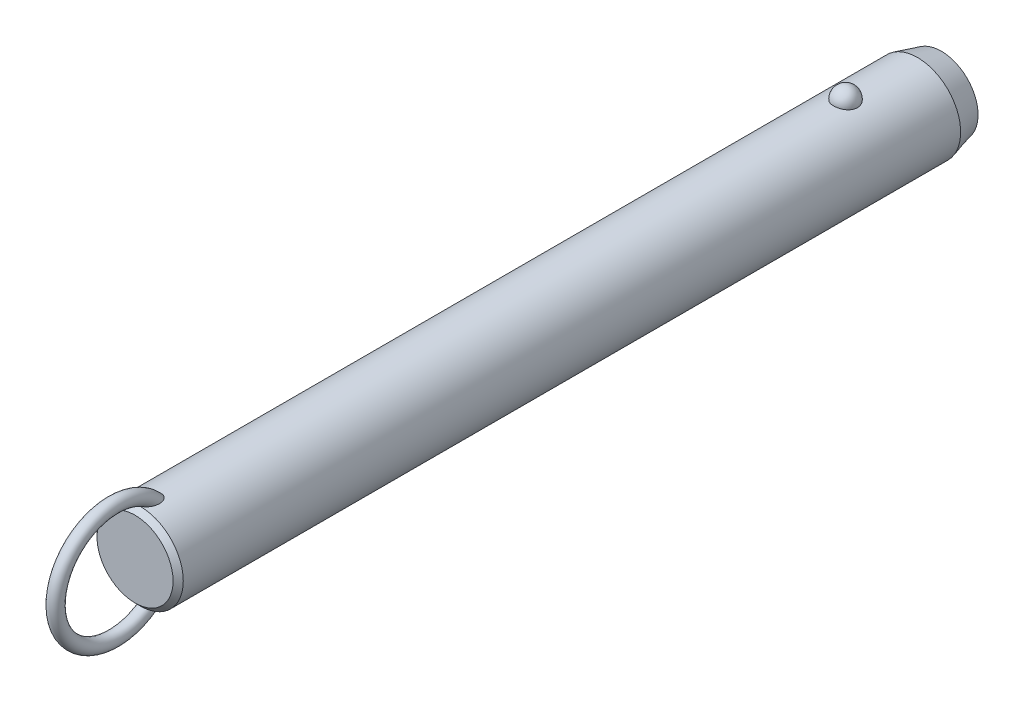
ISO-10303-21;
HEADER;
FILE_DESCRIPTION(('STEP AP214'),'2;1');
FILE_NAME('part.step','',(''),(''),'','','');
FILE_SCHEMA(('AUTOMOTIVE_DESIGN { 1 0 10303 214 1 1 1 1 }'));
ENDSEC;
DATA;
#1=APPLICATION_CONTEXT('core data for automotive mechanical design processes');
#2=APPLICATION_PROTOCOL_DEFINITION('international standard','automotive_design',2000,#1);
#3=PRODUCT_CONTEXT('',#1,'mechanical');
#4=PRODUCT('Part','Part','',(#3));
#5=PRODUCT_RELATED_PRODUCT_CATEGORY('part','',(#4));
#6=PRODUCT_DEFINITION_FORMATION('','',#4);
#7=PRODUCT_DEFINITION_CONTEXT('part definition',#1,'design');
#8=PRODUCT_DEFINITION('design','',#6,#7);
#9=PRODUCT_DEFINITION_SHAPE('','',#8);
#10=(LENGTH_UNIT() NAMED_UNIT(*) SI_UNIT(.MILLI.,.METRE.));
#11=(NAMED_UNIT(*) PLANE_ANGLE_UNIT() SI_UNIT($,.RADIAN.));
#12=(NAMED_UNIT(*) SI_UNIT($,.STERADIAN.) SOLID_ANGLE_UNIT());
#13=UNCERTAINTY_MEASURE_WITH_UNIT(LENGTH_MEASURE(1.E-05),#10,'distance_accuracy_value','');
#14=(GEOMETRIC_REPRESENTATION_CONTEXT(3) GLOBAL_UNCERTAINTY_ASSIGNED_CONTEXT((#13)) GLOBAL_UNIT_ASSIGNED_CONTEXT((#10,
#11,#12)) REPRESENTATION_CONTEXT('',''));
#15=CARTESIAN_POINT('',(0.,0.,0.));
#16=DIRECTION('',(0.,0.,1.));
#17=DIRECTION('',(1.,0.,0.));
#18=AXIS2_PLACEMENT_3D('',#15,#16,#17);
#19=CARTESIAN_POINT('',(0.,0.,193.));
#20=DIRECTION('',(0.,0.,-1.));
#21=DIRECTION('',(-1.,0.,0.));
#22=AXIS2_PLACEMENT_3D('',#19,#20,#21);
#23=CYLINDRICAL_SURFACE('',#22,12.7);
#24=CARTESIAN_POINT('',(3.46661256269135,12.2177165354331,-3.50000000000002));
#25=CARTESIAN_POINT('',(3.4666090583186,12.2177194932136,-3.30432790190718));
#26=CARTESIAN_POINT('',(3.45063567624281,12.2222841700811,-3.10861112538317));
#27=CARTESIAN_POINT('',(3.38712451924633,12.2400345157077,-2.72271899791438));
#28=CARTESIAN_POINT('',(3.33957415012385,12.2532236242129,-2.53254588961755));
#29=CARTESIAN_POINT('',(3.2141234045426,12.286724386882,-2.16324948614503));
#30=CARTESIAN_POINT('',(3.13623639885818,12.3070329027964,-1.98412136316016));
#31=CARTESIAN_POINT('',(2.95205930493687,12.3525018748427,-1.6418059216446));
#32=CARTESIAN_POINT('',(2.84577003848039,12.3776621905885,-1.47861814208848));
#33=CARTESIAN_POINT('',(2.60688050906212,12.4301712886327,-1.17190583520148));
#34=CARTESIAN_POINT('',(2.47415697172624,12.4575299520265,-1.0284789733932));
#35=CARTESIAN_POINT('',(2.18615174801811,12.5112810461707,-0.766177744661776));
#36=CARTESIAN_POINT('',(2.03087002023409,12.5376734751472,-0.647303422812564));
#37=CARTESIAN_POINT('',(1.70237334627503,12.5864761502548,-0.437732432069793));
#38=CARTESIAN_POINT('',(1.52920948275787,12.6088972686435,-0.346958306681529));
#39=CARTESIAN_POINT('',(1.16944170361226,12.6473352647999,-0.195750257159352));
#40=CARTESIAN_POINT('',(0.982839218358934,12.663352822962,-0.135313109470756));
#41=CARTESIAN_POINT('',(0.604961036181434,12.6869706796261,-0.0473241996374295));
#42=CARTESIAN_POINT('',(0.41382314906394,12.6947125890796,-0.0192185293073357));
#43=CARTESIAN_POINT('',(0.0293827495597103,12.7014203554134,0.00517254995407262));
#44=CARTESIAN_POINT('',(-0.163919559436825,12.7003870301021,0.00146092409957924));
#45=CARTESIAN_POINT('',(-0.544374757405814,12.689735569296,-0.0373939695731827));
#46=CARTESIAN_POINT('',(-0.731575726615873,12.6802364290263,-0.0721015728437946));
#47=CARTESIAN_POINT('',(-1.09733277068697,12.6538333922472,-0.171364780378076));
#48=CARTESIAN_POINT('',(-1.27588869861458,12.6369293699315,-0.235920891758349));
#49=CARTESIAN_POINT('',(-1.6204698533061,12.5973946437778,-0.393548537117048));
#50=CARTESIAN_POINT('',(-1.78641865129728,12.5747321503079,-0.486778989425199));
#51=CARTESIAN_POINT('',(-2.10030671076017,12.5261316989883,-0.699110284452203));
#52=CARTESIAN_POINT('',(-2.24824419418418,12.5001934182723,-0.818213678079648));
#53=CARTESIAN_POINT('',(-2.52491489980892,12.4472906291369,-1.0815712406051));
#54=CARTESIAN_POINT('',(-2.65324222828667,12.4203160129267,-1.22624992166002));
#55=CARTESIAN_POINT('',(-2.88410007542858,12.3687509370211,-1.53528325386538));
#56=CARTESIAN_POINT('',(-2.98662883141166,12.3441606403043,-1.69963924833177));
#57=CARTESIAN_POINT('',(-3.16432417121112,12.2998199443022,-2.04548497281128));
#58=CARTESIAN_POINT('',(-3.23917525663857,12.2801261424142,-2.22714424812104));
#59=CARTESIAN_POINT('',(-3.35800573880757,12.248167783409,-2.60091389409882));
#60=CARTESIAN_POINT('',(-3.4019860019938,12.2359030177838,-2.79302397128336));
#61=CARTESIAN_POINT('',(-3.45784812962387,12.2202347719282,-3.18140279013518));
#62=CARTESIAN_POINT('',(-3.46986123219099,12.2167950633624,-3.37765118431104));
#63=CARTESIAN_POINT('',(-3.46186273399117,12.2190638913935,-3.76943689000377));
#64=CARTESIAN_POINT('',(-3.44185196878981,12.2247721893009,-3.96497421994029));
#65=CARTESIAN_POINT('',(-3.37048652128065,12.2446381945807,-4.34881728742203));
#66=CARTESIAN_POINT('',(-3.31928253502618,12.2587552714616,-4.53715319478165));
#67=CARTESIAN_POINT('',(-3.18693461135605,12.2938237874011,-4.9023172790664));
#68=CARTESIAN_POINT('',(-3.1057895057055,12.3147754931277,-5.07914500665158));
#69=CARTESIAN_POINT('',(-2.91506431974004,12.3613125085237,-5.41732059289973));
#70=CARTESIAN_POINT('',(-2.80533587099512,12.3869217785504,-5.57858147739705));
#71=CARTESIAN_POINT('',(-2.560414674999,12.4398525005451,-5.88013283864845));
#72=CARTESIAN_POINT('',(-2.42522099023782,12.4671740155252,-6.02042254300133));
#73=CARTESIAN_POINT('',(-2.1323357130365,12.5205965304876,-6.27662798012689));
#74=CARTESIAN_POINT('',(-1.97456596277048,12.5466928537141,-6.39245542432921));
#75=CARTESIAN_POINT('',(-1.64115839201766,12.5946384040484,-6.59583547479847));
#76=CARTESIAN_POINT('',(-1.46552179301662,12.6164879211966,-6.68339001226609));
#77=CARTESIAN_POINT('',(-1.10356050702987,12.6532533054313,-6.82682153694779));
#78=CARTESIAN_POINT('',(-0.9173913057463,12.6682500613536,-6.88306988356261));
#79=CARTESIAN_POINT('',(-0.537836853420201,12.6900288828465,-6.96386887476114));
#80=CARTESIAN_POINT('',(-0.344452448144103,12.6968119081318,-6.98842322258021));
#81=CARTESIAN_POINT('',(0.0402577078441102,12.7013667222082,-7.00496469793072));
#82=CARTESIAN_POINT('',(0.231556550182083,12.6993008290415,-6.99753844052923));
#83=CARTESIAN_POINT('',(0.610105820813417,12.6867505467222,-6.95166366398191));
#84=CARTESIAN_POINT('',(0.797356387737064,12.6762664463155,-6.91321620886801));
#85=CARTESIAN_POINT('',(1.16186657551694,12.6480587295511,-6.80658431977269));
#86=CARTESIAN_POINT('',(1.33915951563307,12.6303611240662,-6.73850666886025));
#87=CARTESIAN_POINT('',(1.67968518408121,12.5896027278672,-6.57450875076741));
#88=CARTESIAN_POINT('',(1.84291705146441,12.5665416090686,-6.47858678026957));
#89=CARTESIAN_POINT('',(2.15340192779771,12.5171072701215,-6.25982455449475));
#90=CARTESIAN_POINT('',(2.30037831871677,12.4906895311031,-6.13660186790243));
#91=CARTESIAN_POINT('',(2.5717412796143,12.4376567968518,-5.86739587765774));
#92=CARTESIAN_POINT('',(2.69612388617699,12.4110417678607,-5.72140858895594));
#93=CARTESIAN_POINT('',(2.92107785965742,12.360051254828,-5.40794137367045));
#94=CARTESIAN_POINT('',(3.02121329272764,12.3357209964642,-5.24014110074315));
#95=CARTESIAN_POINT('',(3.19236291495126,12.2925446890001,-4.88969865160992));
#96=CARTESIAN_POINT('',(3.26338839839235,12.2736965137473,-4.70706226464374));
#97=CARTESIAN_POINT('',(3.36788038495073,12.245404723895,-4.35469510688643));
#98=CARTESIAN_POINT('',(3.40484026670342,12.2351018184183,-4.18605935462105));
#99=CARTESIAN_POINT('',(3.45420764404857,12.2212564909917,-3.84496058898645));
#100=CARTESIAN_POINT('',(3.46661565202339,12.2177139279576,-3.67249765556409));
#101=CARTESIAN_POINT('',(3.46661256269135,12.2177165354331,-3.50000000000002));
#102=B_SPLINE_CURVE_WITH_KNOTS('',3,(#24,#25,#26,#27,#28,#29,#30,#31,#32,#33,#34,#35,#36,#37,
#38,#39,#40,#41,#42,#43,#44,#45,#46,#47,#48,#49,#50,#51,#52,#53,#54,#55,#56,#57,#58,#59,#60,#61,
#62,#63,#64,#65,#66,#67,#68,#69,#70,#71,#72,#73,#74,#75,#76,#77,#78,#79,#80,#81,#82,#83,#84,#85,
#86,#87,#88,#89,#90,#91,#92,#93,#94,#95,#96,#97,#98,#99,#100,#101),.UNSPECIFIED.,.T.,.F.,(4,2,2,
2,2,2,2,2,2,2,2,2,2,2,2,2,2,2,2,2,2,2,2,2,2,2,2,2,2,2,2,2,2,2,2,2,2,2,4),(0.,0.586396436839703,
1.17302689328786,1.7593990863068,2.34575431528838,2.93491084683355,3.52406845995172,
4.11158733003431,4.69904375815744,5.2762784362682,5.85345931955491,6.42265312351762,
6.99185659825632,7.56427334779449,8.136746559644,8.71981013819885,9.3029135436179,
9.89247258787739,10.4820150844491,11.0691335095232,11.6562366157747,12.2405256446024,
12.8248374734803,13.412244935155,13.9996740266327,14.5891883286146,15.1786623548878,
15.7609861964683,16.3432419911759,16.9148635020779,17.4864654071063,18.0560241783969,
18.6256177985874,19.2037609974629,19.7820055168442,20.3699810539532,20.957728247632,
21.4746855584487,21.9916320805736),.UNSPECIFIED.);
#103=CARTESIAN_POINT('',(3.46661256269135,12.2177165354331,-3.50000000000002));
#104=VERTEX_POINT('',#103);
#105=EDGE_CURVE('E41',#104,#104,#102,.T.);
#106=ORIENTED_EDGE('',*,*,#105,.T.);
#107=EDGE_LOOP('',(#106));
#108=FACE_BOUND('',#107,.T.);
#109=CARTESIAN_POINT('',(0.,0.,204.2));
#110=DIRECTION('',(0.,0.,1.));
#111=DIRECTION('',(1.,0.,0.));
#112=AXIS2_PLACEMENT_3D('',#109,#110,#111);
#113=CIRCLE('',#112,12.7);
#114=CARTESIAN_POINT('',(12.7,0.,204.2));
#115=VERTEX_POINT('',#114);
#116=EDGE_CURVE('E10',#115,#115,#113,.F.);
#117=ORIENTED_EDGE('',*,*,#116,.T.);
#118=EDGE_LOOP('',(#117));
#119=FACE_BOUND('',#118,.T.);
#120=CARTESIAN_POINT('',(-0.548122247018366,-12.6881662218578,197.943218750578));
#121=CARTESIAN_POINT('',(-0.648865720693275,-12.6838128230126,197.977926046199));
#122=CARTESIAN_POINT('',(-0.746398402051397,-12.6783867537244,198.022042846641));
#123=CARTESIAN_POINT('',(-0.932125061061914,-12.666091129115,198.126764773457));
#124=CARTESIAN_POINT('',(-1.02030388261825,-12.6592192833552,198.187396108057));
#125=CARTESIAN_POINT('',(-1.18487740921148,-12.6448747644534,198.321847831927));
#126=CARTESIAN_POINT('',(-1.26134296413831,-12.637406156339,198.395582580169));
#127=CARTESIAN_POINT('',(-1.4023120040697,-12.6225412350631,198.553604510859));
#128=CARTESIAN_POINT('',(-1.466814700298,-12.6151449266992,198.63789238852));
#129=CARTESIAN_POINT('',(-1.60714786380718,-12.5981718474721,198.849657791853));
#130=CARTESIAN_POINT('',(-1.67725126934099,-12.588900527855,198.980962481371));
#131=CARTESIAN_POINT('',(-1.79536591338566,-12.5725964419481,199.253247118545));
#132=CARTESIAN_POINT('',(-1.84333535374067,-12.5655679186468,199.394244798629));
#133=CARTESIAN_POINT('',(-1.93422576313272,-12.5519624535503,199.737645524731));
#134=CARTESIAN_POINT('',(-1.96788773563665,-12.5466298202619,199.942557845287));
#135=CARTESIAN_POINT('',(-1.9941399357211,-12.542463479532,200.251760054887));
#136=CARTESIAN_POINT('',(-1.99883864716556,-12.5417153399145,200.355298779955));
#137=CARTESIAN_POINT('',(-2.00078003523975,-12.5414074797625,200.56245124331));
#138=CARTESIAN_POINT('',(-1.99802449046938,-12.5418474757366,200.666064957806));
#139=CARTESIAN_POINT('',(-1.98336733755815,-12.5441750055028,200.91032076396));
#140=CARTESIAN_POINT('',(-1.96851430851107,-12.5465291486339,201.050780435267));
#141=CARTESIAN_POINT('',(-1.92707089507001,-12.5529612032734,201.329960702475));
#142=CARTESIAN_POINT('',(-1.90047458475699,-12.5570399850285,201.468680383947));
#143=CARTESIAN_POINT('',(-1.8361912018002,-12.5666008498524,201.74341135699));
#144=CARTESIAN_POINT('',(-1.79850828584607,-12.57208240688,201.879423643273));
#145=CARTESIAN_POINT('',(-1.71223796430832,-12.5841228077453,202.147842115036));
#146=CARTESIAN_POINT('',(-1.66365679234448,-12.5906810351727,202.280250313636));
#147=CARTESIAN_POINT('',(-1.5780450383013,-12.6016176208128,202.48548877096));
#148=CARTESIAN_POINT('',(-1.54477252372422,-12.6057501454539,202.559914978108));
#149=CARTESIAN_POINT('',(-1.47424480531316,-12.6141930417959,202.706839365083));
#150=CARTESIAN_POINT('',(-1.436990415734,-12.6185033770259,202.779337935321));
#151=CARTESIAN_POINT('',(-1.35825795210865,-12.6272207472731,202.921892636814));
#152=CARTESIAN_POINT('',(-1.31678520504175,-12.6316276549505,202.991951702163));
#153=CARTESIAN_POINT('',(-1.22917793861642,-12.6404532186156,203.129070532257));
#154=CARTESIAN_POINT('',(-1.18304514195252,-12.6448718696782,203.196131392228));
#155=CARTESIAN_POINT('',(-1.0724641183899,-12.6547893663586,203.343874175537));
#156=CARTESIAN_POINT('',(-1.0064223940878,-12.6602600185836,203.423384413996));
#157=CARTESIAN_POINT('',(-0.864441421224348,-12.6707460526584,203.573169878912));
#158=CARTESIAN_POINT('',(-0.788516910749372,-12.6757620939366,203.643458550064));
#159=CARTESIAN_POINT('',(-0.652215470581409,-12.6833591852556,203.748680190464));
#160=CARTESIAN_POINT('',(-0.59498203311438,-12.6861973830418,203.787624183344));
#161=CARTESIAN_POINT('',(-0.475269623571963,-12.6912445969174,203.856489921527));
#162=CARTESIAN_POINT('',(-0.412800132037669,-12.6934547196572,203.886427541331));
#163=CARTESIAN_POINT('',(-0.295749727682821,-12.6966636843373,203.92975652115));
#164=CARTESIAN_POINT('',(-0.241949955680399,-12.6978134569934,203.945218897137));
#165=CARTESIAN_POINT('',(-0.132508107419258,-12.6994261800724,203.966884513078));
#166=CARTESIAN_POINT('',(-0.0768679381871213,-12.6998898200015,203.973097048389));
#167=CARTESIAN_POINT('',(0.0347696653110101,-12.7000752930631,203.975583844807));
#168=CARTESIAN_POINT('',(0.0907676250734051,-12.6997954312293,203.971835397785));
#169=CARTESIAN_POINT('',(0.201283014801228,-12.6985255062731,203.954788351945));
#170=CARTESIAN_POINT('',(0.255799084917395,-12.6975348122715,203.941481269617));
#171=CARTESIAN_POINT('',(0.376042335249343,-12.6946091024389,203.90203792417));
#172=CARTESIAN_POINT('',(0.440950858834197,-12.6924943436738,203.873449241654));
#173=CARTESIAN_POINT('',(0.565350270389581,-12.6875639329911,203.806323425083));
#174=CARTESIAN_POINT('',(0.624828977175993,-12.6847467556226,203.767764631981));
#175=CARTESIAN_POINT('',(0.774116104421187,-12.6767252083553,203.656949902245));
#176=CARTESIAN_POINT('',(0.859449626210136,-12.6711344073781,203.578760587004));
#177=CARTESIAN_POINT('',(1.01789440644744,-12.6593922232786,203.410943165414));
#178=CARTESIAN_POINT('',(1.09096902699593,-12.653239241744,203.321282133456));
#179=CARTESIAN_POINT('',(1.22268793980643,-12.6411674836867,203.140265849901));
#180=CARTESIAN_POINT('',(1.28193986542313,-12.6352572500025,203.049345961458));
#181=CARTESIAN_POINT('',(1.39259777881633,-12.6235401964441,202.862792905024));
#182=CARTESIAN_POINT('',(1.44399707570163,-12.6177334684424,202.767155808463));
#183=CARTESIAN_POINT('',(1.53972870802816,-12.6064093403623,202.572273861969));
#184=CARTESIAN_POINT('',(1.58405262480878,-12.6008922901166,202.473024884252));
#185=CARTESIAN_POINT('',(1.66600705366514,-12.5903187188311,202.271772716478));
#186=CARTESIAN_POINT('',(1.70363651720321,-12.5852622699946,202.169769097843));
#187=CARTESIAN_POINT('',(1.77545379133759,-12.5753406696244,201.954358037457));
#188=CARTESIAN_POINT('',(1.80903453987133,-12.5705328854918,201.840745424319));
#189=CARTESIAN_POINT('',(1.86844163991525,-12.5618400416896,201.611457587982));
#190=CARTESIAN_POINT('',(1.89426665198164,-12.5579551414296,201.495782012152));
#191=CARTESIAN_POINT('',(1.9378546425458,-12.5513030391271,201.263007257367));
#192=CARTESIAN_POINT('',(1.9556264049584,-12.5485346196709,201.145909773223));
#193=CARTESIAN_POINT('',(1.98264463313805,-12.5442934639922,200.910747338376));
#194=CARTESIAN_POINT('',(1.99189298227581,-12.5428204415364,200.79268260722));
#195=CARTESIAN_POINT('',(2.00416068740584,-12.540871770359,200.480622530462));
#196=CARTESIAN_POINT('',(1.99944433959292,-12.541631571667,200.286229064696));
#197=CARTESIAN_POINT('',(1.96113755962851,-12.5476846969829,199.900309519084));
#198=CARTESIAN_POINT('',(1.92758341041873,-12.5529723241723,199.708780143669));
#199=CARTESIAN_POINT('',(1.83934342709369,-12.5661532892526,199.382272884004));
#200=CARTESIAN_POINT('',(1.79215440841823,-12.5730485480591,199.24524997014));
#201=CARTESIAN_POINT('',(1.67676242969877,-12.588958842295,198.980445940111));
#202=CARTESIAN_POINT('',(1.60859050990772,-12.597970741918,198.852651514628));
#203=CARTESIAN_POINT('',(1.46583832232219,-12.6152829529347,198.635800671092));
#204=CARTESIAN_POINT('',(1.39525727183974,-12.6233659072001,198.54410500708));
#205=CARTESIAN_POINT('',(1.23992594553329,-12.6395676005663,198.373485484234));
#206=CARTESIAN_POINT('',(1.15517932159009,-12.6476863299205,198.294558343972));
#207=CARTESIAN_POINT('',(0.971995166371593,-12.6630846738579,198.152643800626));
#208=CARTESIAN_POINT('',(0.873456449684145,-12.6703572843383,198.089784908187));
#209=CARTESIAN_POINT('',(0.665847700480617,-12.6829569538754,197.984487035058));
#210=CARTESIAN_POINT('',(0.556784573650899,-12.688285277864,197.942034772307));
#211=CARTESIAN_POINT('',(0.347338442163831,-12.6956226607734,197.884443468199));
#212=CARTESIAN_POINT('',(0.247759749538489,-12.6979816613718,197.866399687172));
#213=CARTESIAN_POINT('',(0.0470218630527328,-12.7003077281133,197.848600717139));
#214=CARTESIAN_POINT('',(-0.0541350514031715,-12.7002779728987,197.848821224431));
#215=CARTESIAN_POINT('',(-0.221414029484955,-12.6982482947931,197.864363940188));
#216=CARTESIAN_POINT('',(-0.288055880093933,-12.6969033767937,197.874666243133));
#217=CARTESIAN_POINT('',(-0.419599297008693,-12.6932369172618,197.90313489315));
#218=CARTESIAN_POINT('',(-0.484501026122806,-12.6909154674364,197.921300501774));
#219=CARTESIAN_POINT('',(-0.548122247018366,-12.6881662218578,197.943218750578));
#220=B_SPLINE_CURVE_WITH_KNOTS('',3,(#120,#121,#122,#123,#124,#125,#126,#127,#128,#129,#130,
#131,#132,#133,#134,#135,#136,#137,#138,#139,#140,#141,#142,#143,#144,#145,#146,#147,#148,#149,
#150,#151,#152,#153,#154,#155,#156,#157,#158,#159,#160,#161,#162,#163,#164,#165,#166,#167,#168,
#169,#170,#171,#172,#173,#174,#175,#176,#177,#178,#179,#180,#181,#182,#183,#184,#185,#186,#187,
#188,#189,#190,#191,#192,#193,#194,#195,#196,#197,#198,#199,#200,#201,#202,#203,#204,#205,#206,
#207,#208,#209,#210,#211,#212,#213,#214,#215,#216,#217,#218,#219),.UNSPECIFIED.,.T.,.F.,(4,2,2,
2,2,2,2,2,2,2,2,2,2,2,2,2,2,2,2,2,2,2,2,2,2,2,2,2,2,2,2,2,2,2,2,2,2,2,2,2,2,2,2,2,2,2,2,2,2,4),
(0.,0.31964225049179,0.639794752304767,0.957927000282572,1.27608021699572,1.72100165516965,
2.16675988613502,2.78630021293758,3.09705782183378,3.40774128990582,3.83096358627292,
4.25439969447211,4.67767724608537,5.10071330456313,5.34550297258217,5.59024267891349,
5.83467707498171,6.07902143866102,6.38891080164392,6.69834321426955,6.9056091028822,
7.11250749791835,7.27977315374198,7.44687060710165,7.61434932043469,7.78197685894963,
7.99365544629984,8.20579780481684,8.55147335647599,8.89816429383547,9.22375138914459,
9.54961437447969,9.87586224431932,10.202161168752,10.557587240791,10.9130746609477,
11.2681734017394,11.6231936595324,12.2046601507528,12.7853961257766,13.219164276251,
13.6522938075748,13.9989174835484,14.3454519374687,14.6946768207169,15.0436740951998,
15.3457513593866,15.6474266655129,15.8493051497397,16.0511646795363),.UNSPECIFIED.);
#221=CARTESIAN_POINT('',(-0.548122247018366,-12.6881662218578,197.943218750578));
#222=VERTEX_POINT('',#221);
#223=EDGE_CURVE('E60',#222,#222,#220,.T.);
#224=ORIENTED_EDGE('',*,*,#223,.T.);
#225=EDGE_LOOP('',(#224));
#226=FACE_BOUND('',#225,.T.);
#227=CARTESIAN_POINT('',(-0.548122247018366,12.6881662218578,197.943218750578));
#228=CARTESIAN_POINT('',(-0.459436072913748,12.6919968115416,197.912673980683));
#229=CARTESIAN_POINT('',(-0.368189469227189,12.6949996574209,197.889391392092));
#230=CARTESIAN_POINT('',(-0.183024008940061,12.6990186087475,197.858406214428));
#231=CARTESIAN_POINT('',(-0.0891049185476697,12.7000345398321,197.850704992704));
#232=CARTESIAN_POINT('',(0.0987147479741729,12.6999636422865,197.851245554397));
#233=CARTESIAN_POINT('',(0.192615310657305,12.6988761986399,197.859492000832));
#234=CARTESIAN_POINT('',(0.377658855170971,12.6947211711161,197.891551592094));
#235=CARTESIAN_POINT('',(0.468801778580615,12.6916535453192,197.915365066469));
#236=CARTESIAN_POINT('',(0.645809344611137,12.6838788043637,197.97745651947));
#237=CARTESIAN_POINT('',(0.731679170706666,12.6791733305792,198.015720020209));
#238=CARTESIAN_POINT('',(0.896315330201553,12.6686004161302,198.105120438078));
#239=CARTESIAN_POINT('',(0.97508059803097,12.6627328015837,198.156259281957));
#240=CARTESIAN_POINT('',(1.12963655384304,12.6499161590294,198.27367820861));
#241=CARTESIAN_POINT('',(1.20478673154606,12.6429194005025,198.340792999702));
#242=CARTESIAN_POINT('',(1.34448241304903,12.6288282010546,198.48522507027));
#243=CARTESIAN_POINT('',(1.40902173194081,12.621733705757,198.562548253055));
#244=CARTESIAN_POINT('',(1.55208211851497,12.6050877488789,198.759247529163));
#245=CARTESIAN_POINT('',(1.62510490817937,12.5957546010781,198.882654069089));
#246=CARTESIAN_POINT('',(1.7501904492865,12.5789823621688,199.139769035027));
#247=CARTESIAN_POINT('',(1.8022137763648,12.5715468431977,199.273496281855));
#248=CARTESIAN_POINT('',(1.90309965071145,12.5567434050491,199.598351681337));
#249=CARTESIAN_POINT('',(1.94342317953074,12.5504515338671,199.792161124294));
#250=CARTESIAN_POINT('',(1.99332997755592,12.5426147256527,200.18378810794));
#251=CARTESIAN_POINT('',(2.00285305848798,12.5410790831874,200.381612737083));
#252=CARTESIAN_POINT('',(1.99678999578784,12.5420407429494,200.716642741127));
#253=CARTESIAN_POINT('',(1.98794117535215,12.5434564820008,200.854042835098));
#254=CARTESIAN_POINT('',(1.95865119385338,12.5480641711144,201.127639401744));
#255=CARTESIAN_POINT('',(1.93820436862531,12.5512569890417,201.263835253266));
#256=CARTESIAN_POINT('',(1.88647896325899,12.5591352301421,201.534249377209));
#257=CARTESIAN_POINT('',(1.85518800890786,12.5638223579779,201.668465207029));
#258=CARTESIAN_POINT('',(1.78217886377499,12.5743868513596,201.933936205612));
#259=CARTESIAN_POINT('',(1.74046509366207,12.5802637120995,202.065192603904));
#260=CARTESIAN_POINT('',(1.66024095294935,12.5910571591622,202.286085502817));
#261=CARTESIAN_POINT('',(1.62434772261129,12.5957535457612,202.376690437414));
#262=CARTESIAN_POINT('',(1.54709009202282,12.6054762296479,202.555512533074));
#263=CARTESIAN_POINT('',(1.50572681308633,12.6105024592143,202.643730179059));
#264=CARTESIAN_POINT('',(1.41728020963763,12.620748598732,202.816932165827));
#265=CARTESIAN_POINT('',(1.37021377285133,12.625967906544,202.901925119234));
#266=CARTESIAN_POINT('',(1.26969620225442,12.6364721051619,203.068007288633));
#267=CARTESIAN_POINT('',(1.21624929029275,12.6417569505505,203.149099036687));
#268=CARTESIAN_POINT('',(1.10304413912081,12.6521331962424,203.304702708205));
#269=CARTESIAN_POINT('',(1.04340936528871,12.657226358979,203.379303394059));
#270=CARTESIAN_POINT('',(0.915919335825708,12.667090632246,203.521324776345));
#271=CARTESIAN_POINT('',(0.848064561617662,12.6718617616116,203.58874589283));
#272=CARTESIAN_POINT('',(0.717035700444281,12.67987711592,203.700624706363));
#273=CARTESIAN_POINT('',(0.655526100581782,12.6832377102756,203.746997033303));
#274=CARTESIAN_POINT('',(0.525985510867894,12.6892676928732,203.829619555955));
#275=CARTESIAN_POINT('',(0.457969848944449,12.6919386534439,203.865892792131));
#276=CARTESIAN_POINT('',(0.334859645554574,12.695691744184,203.916657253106));
#277=CARTESIAN_POINT('',(0.281116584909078,12.6970073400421,203.934373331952));
#278=CARTESIAN_POINT('',(0.171425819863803,12.6989609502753,203.960642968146));
#279=CARTESIAN_POINT('',(0.115480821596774,12.699599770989,203.969207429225));
#280=CARTESIAN_POINT('',(0.00272618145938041,12.7001251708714,203.976253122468));
#281=CARTESIAN_POINT('',(-0.0540859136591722,12.7000089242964,203.974696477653));
#282=CARTESIAN_POINT('',(-0.16654462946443,12.6990328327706,203.961600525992));
#283=CARTESIAN_POINT('',(-0.222190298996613,12.6981724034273,203.950053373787));
#284=CARTESIAN_POINT('',(-0.342018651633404,12.695562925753,203.914912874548));
#285=CARTESIAN_POINT('',(-0.405606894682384,12.6936676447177,203.88933225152));
#286=CARTESIAN_POINT('',(-0.527815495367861,12.6891754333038,203.828311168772));
#287=CARTESIAN_POINT('',(-0.586425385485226,12.6865770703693,203.792850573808));
#288=CARTESIAN_POINT('',(-0.731842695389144,12.6792129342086,203.691496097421));
#289=CARTESIAN_POINT('',(-0.81470941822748,12.6740767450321,203.6200395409));
#290=CARTESIAN_POINT('',(-0.969101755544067,12.6632083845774,203.46589007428));
#291=CARTESIAN_POINT('',(-1.04059564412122,12.6574746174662,203.383166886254));
#292=CARTESIAN_POINT('',(-1.16981116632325,12.6461638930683,203.215809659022));
#293=CARTESIAN_POINT('',(-1.22811369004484,12.6405994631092,203.131616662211));
#294=CARTESIAN_POINT('',(-1.33743405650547,12.6295007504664,202.958579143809));
#295=CARTESIAN_POINT('',(-1.38844577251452,12.6239664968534,202.869730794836));
#296=CARTESIAN_POINT('',(-1.48400702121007,12.6130898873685,202.688389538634));
#297=CARTESIAN_POINT('',(-1.52854232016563,12.6077479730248,202.595889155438));
#298=CARTESIAN_POINT('',(-1.61150113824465,12.5974127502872,202.408160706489));
#299=CARTESIAN_POINT('',(-1.64992317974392,12.5924195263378,202.312931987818));
#300=CARTESIAN_POINT('',(-1.73468589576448,12.581070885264,202.08289362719));
#301=CARTESIAN_POINT('',(-1.77831261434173,12.5749388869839,201.947066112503));
#302=CARTESIAN_POINT('',(-1.85439734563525,12.5639437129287,201.672212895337));
#303=CARTESIAN_POINT('',(-1.88684994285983,12.5590811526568,201.533185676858));
#304=CARTESIAN_POINT('',(-1.94008483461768,12.550968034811,201.25309235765));
#305=CARTESIAN_POINT('',(-1.96088706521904,12.5477147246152,201.112030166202));
#306=CARTESIAN_POINT('',(-1.99000539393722,12.5431291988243,200.828668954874));
#307=CARTESIAN_POINT('',(-1.99832911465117,12.5417958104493,200.686370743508));
#308=CARTESIAN_POINT('',(-2.00166624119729,12.5412674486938,200.357627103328));
#309=CARTESIAN_POINT('',(-1.99178843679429,12.5428579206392,200.171088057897));
#310=CARTESIAN_POINT('',(-1.94455183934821,12.5502731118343,199.80162404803));
#311=CARTESIAN_POINT('',(-1.90724032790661,12.5560905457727,199.618693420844));
#312=CARTESIAN_POINT('',(-1.81330718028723,12.5699462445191,199.304848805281));
#313=CARTESIAN_POINT('',(-1.76338820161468,12.5771273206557,199.171910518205));
#314=CARTESIAN_POINT('',(-1.64305018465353,12.593414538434,198.915681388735));
#315=CARTESIAN_POINT('',(-1.57265346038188,12.6025185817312,198.792380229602));
#316=CARTESIAN_POINT('',(-1.42634956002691,12.6198178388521,198.583564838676));
#317=CARTESIAN_POINT('',(-1.35423772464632,12.6278405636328,198.495384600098));
#318=CARTESIAN_POINT('',(-1.19645664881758,12.6437632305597,198.332107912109));
#319=CARTESIAN_POINT('',(-1.1108053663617,12.6516633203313,198.256994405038));
#320=CARTESIAN_POINT('',(-0.947219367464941,12.6648319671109,198.137811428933));
#321=CARTESIAN_POINT('',(-0.871624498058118,12.670300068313,198.090541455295));
#322=CARTESIAN_POINT('',(-0.714161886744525,12.6801492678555,198.0077413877));
#323=CARTESIAN_POINT('',(-0.632295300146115,12.684530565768,197.97220913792));
#324=CARTESIAN_POINT('',(-0.548122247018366,12.6881662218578,197.943218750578));
#325=B_SPLINE_CURVE_WITH_KNOTS('',3,(#227,#228,#229,#230,#231,#232,#233,#234,#235,#236,#237,
#238,#239,#240,#241,#242,#243,#244,#245,#246,#247,#248,#249,#250,#251,#252,#253,#254,#255,#256,
#257,#258,#259,#260,#261,#262,#263,#264,#265,#266,#267,#268,#269,#270,#271,#272,#273,#274,#275,
#276,#277,#278,#279,#280,#281,#282,#283,#284,#285,#286,#287,#288,#289,#290,#291,#292,#293,#294,
#295,#296,#297,#298,#299,#300,#301,#302,#303,#304,#305,#306,#307,#308,#309,#310,#311,#312,#313,
#314,#315,#316,#317,#318,#319,#320,#321,#322,#323,#324),.UNSPECIFIED.,.T.,.F.,(4,2,2,2,2,2,2,2,
2,2,2,2,2,2,2,2,2,2,2,2,2,2,2,2,2,2,2,2,2,2,2,2,2,2,2,2,2,2,2,2,2,2,2,2,2,2,2,2,4),(0.,
0.281328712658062,0.562682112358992,0.844117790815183,1.12555942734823,1.40671982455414,
1.68792232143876,1.98972294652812,2.29169886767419,2.72039860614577,3.14989948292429,
3.74084916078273,4.33295293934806,4.74554109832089,5.15833092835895,5.57159335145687,
5.98468079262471,6.27722775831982,6.56971484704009,6.86135609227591,7.15280542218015,
7.43927407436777,7.72572595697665,7.95635862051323,8.18646071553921,8.35559393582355,
8.52452541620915,8.69408946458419,8.86378678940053,9.06834348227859,9.27332014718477,
9.60010414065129,9.92778432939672,10.2350252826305,10.5425229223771,10.8506864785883,
11.15892440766,11.5867893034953,12.0148612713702,12.4421984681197,12.8692745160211,
13.4279365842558,13.9856380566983,14.4107062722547,14.835313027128,15.1765567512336,
15.517351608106,15.7844129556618,16.051425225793),.UNSPECIFIED.);
#326=CARTESIAN_POINT('',(-0.548122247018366,12.6881662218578,197.943218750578));
#327=VERTEX_POINT('',#326);
#328=EDGE_CURVE('E68',#327,#327,#325,.T.);
#329=ORIENTED_EDGE('',*,*,#328,.T.);
#330=EDGE_LOOP('',(#329));
#331=FACE_BOUND('',#330,.T.);
#332=CARTESIAN_POINT('',(0.,0.,-24.6999999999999));
#333=DIRECTION('',(0.,0.,-1.));
#334=DIRECTION('',(-1.,0.,0.));
#335=AXIS2_PLACEMENT_3D('',#332,#333,#334);
#336=CIRCLE('',#335,12.7);
#337=CARTESIAN_POINT('',(-12.7,0.,-24.6999999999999));
#338=VERTEX_POINT('',#337);
#339=EDGE_CURVE('E57',#338,#338,#336,.F.);
#340=ORIENTED_EDGE('',*,*,#339,.T.);
#341=EDGE_LOOP('',(#340));
#342=FACE_BOUND('',#341,.T.);
#343=ADVANCED_FACE('F37',(#108,#119,#226,#331,#342),#23,.T.);
#344=CARTESIAN_POINT('',(0.,0.,-31.7));
#345=DIRECTION('',(0.,0.,-1.));
#346=DIRECTION('',(-1.,0.,0.));
#347=AXIS2_PLACEMENT_3D('',#344,#345,#346);
#348=PLANE('',#347);
#349=CARTESIAN_POINT('',(0.,0.,-31.7));
#350=DIRECTION('',(0.,0.,-1.));
#351=DIRECTION('',(-1.,0.,0.));
#352=AXIS2_PLACEMENT_3D('',#349,#350,#351);
#353=CIRCLE('',#352,10.8243556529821);
#354=CARTESIAN_POINT('',(-10.8243556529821,0.,-31.7));
#355=VERTEX_POINT('',#354);
#356=EDGE_CURVE('E67',#355,#355,#353,.T.);
#357=ORIENTED_EDGE('',*,*,#356,.T.);
#358=EDGE_LOOP('',(#357));
#359=FACE_BOUND('',#358,.T.);
#360=ADVANCED_FACE('F86',(#359),#348,.T.);
#361=CARTESIAN_POINT('',(0.,0.,-31.7));
#362=DIRECTION('',(0.,0.,1.));
#363=DIRECTION('',(1.,0.,0.));
#364=AXIS2_PLACEMENT_3D('',#361,#362,#363);
#365=CONICAL_SURFACE('',#364,10.8243556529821,0.261799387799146);
#366=ORIENTED_EDGE('',*,*,#339,.F.);
#367=EDGE_LOOP('',(#366));
#368=FACE_BOUND('',#367,.T.);
#369=ORIENTED_EDGE('',*,*,#356,.F.);
#370=EDGE_LOOP('',(#369));
#371=FACE_BOUND('',#370,.T.);
#372=ADVANCED_FACE('F84',(#368,#371),#365,.T.);
#373=CARTESIAN_POINT('',(0.,0.,205.7));
#374=DIRECTION('',(0.,0.,1.));
#375=DIRECTION('',(1.,0.,0.));
#376=AXIS2_PLACEMENT_3D('',#373,#374,#375);
#377=PLANE('',#376);
#378=CARTESIAN_POINT('',(0.,0.,205.7));
#379=DIRECTION('',(0.,0.,1.));
#380=DIRECTION('',(1.,0.,0.));
#381=AXIS2_PLACEMENT_3D('',#378,#379,#380);
#382=CIRCLE('',#381,11.2);
#383=CARTESIAN_POINT('',(11.2,0.,205.7));
#384=VERTEX_POINT('',#383);
#385=EDGE_CURVE('E50',#384,#384,#382,.T.);
#386=ORIENTED_EDGE('',*,*,#385,.T.);
#387=EDGE_LOOP('',(#386));
#388=FACE_BOUND('',#387,.T.);
#389=ADVANCED_FACE('F78',(#388),#377,.T.);
#390=CARTESIAN_POINT('',(0.,0.,212.05));
#391=DIRECTION('',(1.,0.,0.));
#392=DIRECTION('',(0.,0.,-1.));
#393=AXIS2_PLACEMENT_3D('',#390,#391,#392);
#394=TOROIDAL_SURFACE('',#393,17.05,2.);
#395=ORIENTED_EDGE('',*,*,#328,.F.);
#396=EDGE_LOOP('',(#395));
#397=FACE_BOUND('',#396,.T.);
#398=ORIENTED_EDGE('',*,*,#223,.F.);
#399=EDGE_LOOP('',(#398));
#400=FACE_BOUND('',#399,.T.);
#401=ADVANCED_FACE('F74',(#397,#400),#394,.T.);
#402=CARTESIAN_POINT('',(0.,0.,205.7));
#403=DIRECTION('',(0.,0.,-1.));
#404=DIRECTION('',(-1.,0.,0.));
#405=AXIS2_PLACEMENT_3D('',#402,#403,#404);
#406=CONICAL_SURFACE('',#405,11.2,0.785398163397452);
#407=ORIENTED_EDGE('',*,*,#116,.F.);
#408=EDGE_LOOP('',(#407));
#409=FACE_BOUND('',#408,.T.);
#410=ORIENTED_EDGE('',*,*,#385,.F.);
#411=EDGE_LOOP('',(#410));
#412=FACE_BOUND('',#411,.T.);
#413=ADVANCED_FACE('F39',(#409,#412),#406,.T.);
#414=CARTESIAN_POINT('',(0.,12.7,-3.50000000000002));
#415=DIRECTION('',(0.,1.,0.));
#416=DIRECTION('',(0.,0.,-1.));
#417=AXIS2_PLACEMENT_3D('',#414,#415,#416);
#418=SPHERICAL_SURFACE('',#417,3.5);
#419=ORIENTED_EDGE('',*,*,#105,.F.);
#420=EDGE_LOOP('',(#419));
#421=FACE_BOUND('',#420,.T.);
#422=ADVANCED_FACE('F80',(#421),#418,.T.);
#423=CLOSED_SHELL('',(#343,#360,#372,#389,#401,#413,#422));
#424=MANIFOLD_SOLID_BREP('B2',#423);
#425=ADVANCED_BREP_SHAPE_REPRESENTATION('',(#18,#424),#14);
#426=SHAPE_DEFINITION_REPRESENTATION(#9,#425);
ENDSEC;
END-ISO-10303-21;
